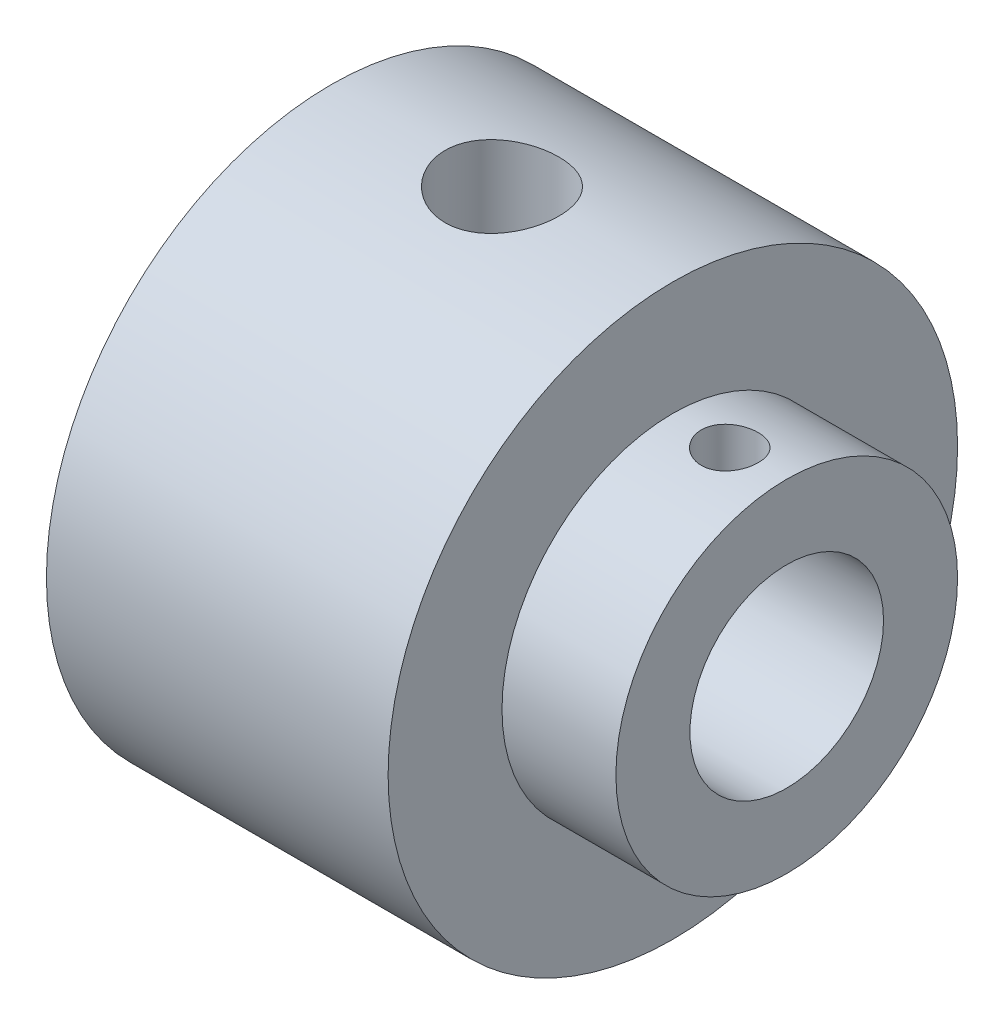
from build123d import *

# Parameters (mm, degrees)
SKETCH2_R             = 8.5
EXTRUDE1_DEPTH        = 54.38539126
SKETCH3_R             = 5
EXTRUDE2_DEPTH        = 25
M6_TAPPED_HOLE2_D     = 5
M6_TAPPED_HOLE2_DEPTH = 15


with BuildPart() as part:
    # Sketch1 → Revolve1 (revolve)
    with BuildSketch(Plane.XY, mode=Mode.PRIVATE) as revolve1_sk:
        Polygon((0, 0), (40, 0), (40, 15), (30, 15), (30, 25), (0, 25), align=None)
    revolve(revolve1_sk.sketch.rotate(Axis((0, 0, 0), (1, 0, 0)), 90), axis=Axis((0, 0, 0), (1, 0, 0)))

    # Sketch2 → Extrude1 (cut, through all)
    with BuildSketch(Plane(origin=(40, 0, 0), x_dir=(0, 0, -1), z_dir=(1, 0, 0))):
        Circle(SKETCH2_R)
    extrude(amount=-EXTRUDE1_DEPTH, mode=Mode.SUBTRACT)

    # Sketch3 → Extrude2 (cut)
    with BuildSketch(Plane(origin=(0, 25, 0), x_dir=(-1, 0, 0), z_dir=(0, 1, 0))):
        with Locations(Location((-15, 0, 0), (0, 0, 90))):
            Circle(SKETCH3_R)
    extrude(amount=-EXTRUDE2_DEPTH, mode=Mode.SUBTRACT)

    # M6 Tapped Hole2
    with Locations(Plane(origin=(35, 15, 0), x_dir=(0, 0, 1), z_dir=(0, 1, 0))):
        with Locations((0, 0)):
            Hole(M6_TAPPED_HOLE2_D / 2, depth=M6_TAPPED_HOLE2_DEPTH)


solid = part.part
